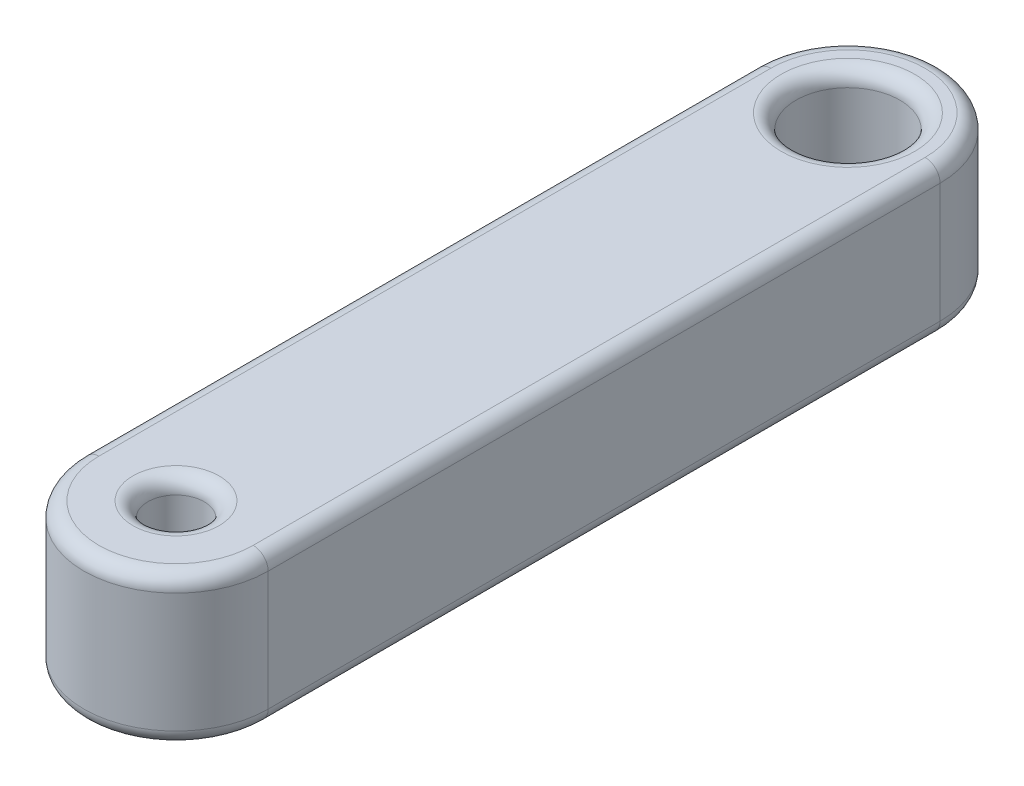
from build123d import *

# Parameters (mm, degrees)
SKETCH1_R           = 3.475
SKETCH1_R_2         = 1.8875
BOSS_EXTRUDE1_DEPTH = 10
FILLET1_R           = 1


with BuildPart() as part:
    # Sketch1 → Boss-Extrude1 (new body)
    with BuildSketch(Plane(origin=(0, 0, 0), x_dir=(1, 0, 0), z_dir=(0, 1, 0))):
        with BuildLine():
            Line((6.168831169, 0), (6.168831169, -45))
            ThreePointArc((6.168831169, -45), (0, -51.168831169), (-6.168831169, -45))
            Line((-6.168831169, -45), (-6.168831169, 0))
            ThreePointArc((-6.168831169, 0), (0, 6.168831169), (6.168831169, 0))
        make_face()
        with Locations(Location((0, 0, 0), (0, 0, 270))):
            Circle(SKETCH1_R, mode=Mode.SUBTRACT)
        with Locations(Location((0, -45, 0), (0, 0, 270))):
            Circle(SKETCH1_R_2, mode=Mode.SUBTRACT)
    extrude(amount=BOSS_EXTRUDE1_DEPTH)

    # Fillet1
    fillet1_edges = [part.edges().sort_by_distance(p)[0] for p in [
        (0, 10, 51.168831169),
        (0, 0, -3.475),
        (0, 10, -3.475),
        (6.168831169, 10, 22.5),
        (0, 0, 43.1125),
        (0, 10, 43.1125),
        (0, 10, -6.168831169),
        (6.168831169, 0, 22.5),
        (0, 0, 51.168831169),
        (-6.168831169, 0, 22.5),
        (0, 0, -6.168831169),
        (-6.168831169, 10, 22.5),
    ]]
    fillet(fillet1_edges, radius=FILLET1_R)


solid = part.part
